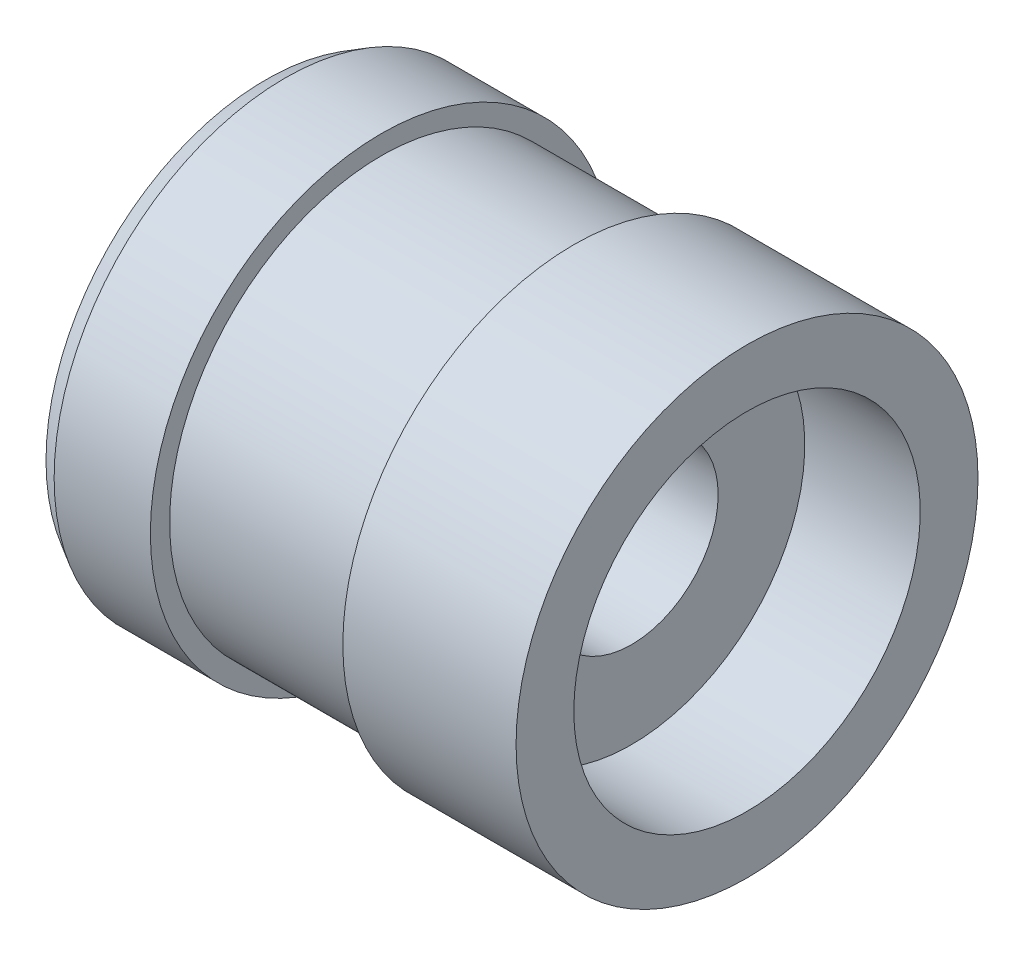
ISO-10303-21;
HEADER;
FILE_DESCRIPTION(('STEP AP214'),'2;1');
FILE_NAME('part.step','',(''),(''),'','','');
FILE_SCHEMA(('AUTOMOTIVE_DESIGN { 1 0 10303 214 1 1 1 1 }'));
ENDSEC;
DATA;
#1=APPLICATION_CONTEXT('core data for automotive mechanical design processes');
#2=APPLICATION_PROTOCOL_DEFINITION('international standard','automotive_design',2000,#1);
#3=PRODUCT_CONTEXT('',#1,'mechanical');
#4=PRODUCT('Part','Part','',(#3));
#5=PRODUCT_RELATED_PRODUCT_CATEGORY('part','',(#4));
#6=PRODUCT_DEFINITION_FORMATION('','',#4);
#7=PRODUCT_DEFINITION_CONTEXT('part definition',#1,'design');
#8=PRODUCT_DEFINITION('design','',#6,#7);
#9=PRODUCT_DEFINITION_SHAPE('','',#8);
#10=(LENGTH_UNIT() NAMED_UNIT(*) SI_UNIT(.MILLI.,.METRE.));
#11=(NAMED_UNIT(*) PLANE_ANGLE_UNIT() SI_UNIT($,.RADIAN.));
#12=(NAMED_UNIT(*) SI_UNIT($,.STERADIAN.) SOLID_ANGLE_UNIT());
#13=UNCERTAINTY_MEASURE_WITH_UNIT(LENGTH_MEASURE(1.E-05),#10,'distance_accuracy_value','');
#14=(GEOMETRIC_REPRESENTATION_CONTEXT(3) GLOBAL_UNCERTAINTY_ASSIGNED_CONTEXT((#13)) GLOBAL_UNIT_ASSIGNED_CONTEXT((#10,
#11,#12)) REPRESENTATION_CONTEXT('',''));
#15=CARTESIAN_POINT('',(0.,0.,0.));
#16=DIRECTION('',(0.,0.,1.));
#17=DIRECTION('',(1.,0.,0.));
#18=AXIS2_PLACEMENT_3D('',#15,#16,#17);
#19=CARTESIAN_POINT('',(0.,0.,0.));
#20=DIRECTION('',(1.,0.,0.));
#21=DIRECTION('',(0.,0.,-1.));
#22=AXIS2_PLACEMENT_3D('',#19,#20,#21);
#23=CYLINDRICAL_SURFACE('',#22,6.);
#24=CARTESIAN_POINT('',(0.5,0.,0.));
#25=DIRECTION('',(-1.,0.,0.));
#26=DIRECTION('',(0.,0.,1.));
#27=AXIS2_PLACEMENT_3D('',#24,#25,#26);
#28=CIRCLE('',#27,6.);
#29=CARTESIAN_POINT('',(0.5,0.,6.));
#30=VERTEX_POINT('',#29);
#31=EDGE_CURVE('E42',#30,#30,#28,.F.);
#32=ORIENTED_EDGE('',*,*,#31,.T.);
#33=EDGE_LOOP('',(#32));
#34=FACE_BOUND('',#33,.T.);
#35=CARTESIAN_POINT('',(3.,0.,0.));
#36=DIRECTION('',(1.,0.,0.));
#37=DIRECTION('',(0.,0.,-1.));
#38=AXIS2_PLACEMENT_3D('',#35,#36,#37);
#39=CIRCLE('',#38,6.);
#40=CARTESIAN_POINT('',(3.,0.,-6.00000000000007));
#41=VERTEX_POINT('',#40);
#42=EDGE_CURVE('E61',#41,#41,#39,.T.);
#43=ORIENTED_EDGE('',*,*,#42,.F.);
#44=EDGE_LOOP('',(#43));
#45=FACE_BOUND('',#44,.T.);
#46=ADVANCED_FACE('F35',(#34,#45),#23,.T.);
#47=CARTESIAN_POINT('',(0.,6.,0.));
#48=DIRECTION('',(-1.,0.,0.));
#49=DIRECTION('',(0.,0.,1.));
#50=AXIS2_PLACEMENT_3D('',#47,#48,#49);
#51=PLANE('',#50);
#52=CARTESIAN_POINT('',(0.,0.,0.));
#53=DIRECTION('',(-1.,0.,0.));
#54=DIRECTION('',(0.,0.,1.));
#55=AXIS2_PLACEMENT_3D('',#52,#53,#54);
#56=CIRCLE('',#55,5.71132486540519);
#57=CARTESIAN_POINT('',(0.,0.,5.71132486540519));
#58=VERTEX_POINT('',#57);
#59=EDGE_CURVE('E10',#58,#58,#56,.T.);
#60=ORIENTED_EDGE('',*,*,#59,.T.);
#61=EDGE_LOOP('',(#60));
#62=FACE_BOUND('',#61,.T.);
#63=CARTESIAN_POINT('',(0.,0.,0.));
#64=DIRECTION('',(-1.,0.,0.));
#65=DIRECTION('',(0.,0.,1.));
#66=AXIS2_PLACEMENT_3D('',#63,#64,#65);
#67=CIRCLE('',#66,0.75);
#68=CARTESIAN_POINT('',(0.,0.,0.75));
#69=VERTEX_POINT('',#68);
#70=EDGE_CURVE('E67',#69,#69,#67,.T.);
#71=ORIENTED_EDGE('',*,*,#70,.F.);
#72=EDGE_LOOP('',(#71));
#73=FACE_BOUND('',#72,.T.);
#74=ADVANCED_FACE('F127',(#62,#73),#51,.T.);
#75=CARTESIAN_POINT('',(12.5,0.,0.));
#76=DIRECTION('',(1.,0.,0.));
#77=DIRECTION('',(0.,0.,-1.));
#78=AXIS2_PLACEMENT_3D('',#75,#76,#77);
#79=PLANE('',#78);
#80=CARTESIAN_POINT('',(12.5,0.,0.));
#81=DIRECTION('',(-1.,0.,0.));
#82=DIRECTION('',(0.,0.,1.));
#83=AXIS2_PLACEMENT_3D('',#80,#81,#82);
#84=CIRCLE('',#83,4.5);
#85=CARTESIAN_POINT('',(12.5,0.,4.5));
#86=VERTEX_POINT('',#85);
#87=EDGE_CURVE('E64',#86,#86,#84,.T.);
#88=ORIENTED_EDGE('',*,*,#87,.T.);
#89=EDGE_LOOP('',(#88));
#90=FACE_BOUND('',#89,.T.);
#91=CARTESIAN_POINT('',(12.5,0.,0.));
#92=DIRECTION('',(1.,0.,0.));
#93=DIRECTION('',(0.,0.,-1.));
#94=AXIS2_PLACEMENT_3D('',#91,#92,#93);
#95=CIRCLE('',#94,6.);
#96=CARTESIAN_POINT('',(12.5,0.,-6.));
#97=VERTEX_POINT('',#96);
#98=EDGE_CURVE('E46',#97,#97,#95,.T.);
#99=ORIENTED_EDGE('',*,*,#98,.T.);
#100=EDGE_LOOP('',(#99));
#101=FACE_BOUND('',#100,.T.);
#102=ADVANCED_FACE('F129',(#90,#101),#79,.T.);
#103=CARTESIAN_POINT('',(0.,0.,0.));
#104=DIRECTION('',(1.,0.,0.));
#105=DIRECTION('',(0.,0.,-1.));
#106=AXIS2_PLACEMENT_3D('',#103,#104,#105);
#107=CYLINDRICAL_SURFACE('',#106,6.);
#108=CARTESIAN_POINT('',(8.,0.,0.));
#109=DIRECTION('',(1.,0.,0.));
#110=DIRECTION('',(0.,0.,-1.));
#111=AXIS2_PLACEMENT_3D('',#108,#109,#110);
#112=CIRCLE('',#111,6.);
#113=CARTESIAN_POINT('',(8.,0.,-6.));
#114=VERTEX_POINT('',#113);
#115=EDGE_CURVE('E50',#114,#114,#112,.T.);
#116=ORIENTED_EDGE('',*,*,#115,.T.);
#117=EDGE_LOOP('',(#116));
#118=FACE_BOUND('',#117,.T.);
#119=ORIENTED_EDGE('',*,*,#98,.F.);
#120=EDGE_LOOP('',(#119));
#121=FACE_BOUND('',#120,.T.);
#122=ADVANCED_FACE('F135',(#118,#121),#107,.T.);
#123=CARTESIAN_POINT('',(8.,6.00000000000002,0.));
#124=DIRECTION('',(-1.,0.,0.));
#125=DIRECTION('',(0.,0.,1.));
#126=AXIS2_PLACEMENT_3D('',#123,#124,#125);
#127=PLANE('',#126);
#128=CARTESIAN_POINT('',(8.,0.,0.));
#129=DIRECTION('',(1.,0.,0.));
#130=DIRECTION('',(0.,0.,-1.));
#131=AXIS2_PLACEMENT_3D('',#128,#129,#130);
#132=CIRCLE('',#131,5.5);
#133=CARTESIAN_POINT('',(8.,0.,-5.5));
#134=VERTEX_POINT('',#133);
#135=EDGE_CURVE('E55',#134,#134,#132,.T.);
#136=ORIENTED_EDGE('',*,*,#135,.T.);
#137=EDGE_LOOP('',(#136));
#138=FACE_BOUND('',#137,.T.);
#139=ORIENTED_EDGE('',*,*,#115,.F.);
#140=EDGE_LOOP('',(#139));
#141=FACE_BOUND('',#140,.T.);
#142=ADVANCED_FACE('F141',(#138,#141),#127,.T.);
#143=CARTESIAN_POINT('',(0.,0.,0.));
#144=DIRECTION('',(1.,0.,0.));
#145=DIRECTION('',(0.,0.,-1.));
#146=AXIS2_PLACEMENT_3D('',#143,#144,#145);
#147=CYLINDRICAL_SURFACE('',#146,5.5);
#148=CARTESIAN_POINT('',(3.,0.,0.));
#149=DIRECTION('',(1.,0.,0.));
#150=DIRECTION('',(0.,0.,-1.));
#151=AXIS2_PLACEMENT_3D('',#148,#149,#150);
#152=CIRCLE('',#151,5.5);
#153=CARTESIAN_POINT('',(3.,0.,-5.50000000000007));
#154=VERTEX_POINT('',#153);
#155=EDGE_CURVE('E58',#154,#154,#152,.T.);
#156=ORIENTED_EDGE('',*,*,#155,.T.);
#157=EDGE_LOOP('',(#156));
#158=FACE_BOUND('',#157,.T.);
#159=ORIENTED_EDGE('',*,*,#135,.F.);
#160=EDGE_LOOP('',(#159));
#161=FACE_BOUND('',#160,.T.);
#162=ADVANCED_FACE('F145',(#158,#161),#147,.T.);
#163=CARTESIAN_POINT('',(3.,5.5,0.));
#164=DIRECTION('',(1.,0.,0.));
#165=DIRECTION('',(0.,0.,-1.));
#166=AXIS2_PLACEMENT_3D('',#163,#164,#165);
#167=PLANE('',#166);
#168=ORIENTED_EDGE('',*,*,#42,.T.);
#169=EDGE_LOOP('',(#168));
#170=FACE_BOUND('',#169,.T.);
#171=ORIENTED_EDGE('',*,*,#155,.F.);
#172=EDGE_LOOP('',(#171));
#173=FACE_BOUND('',#172,.T.);
#174=ADVANCED_FACE('F149',(#170,#173),#167,.T.);
#175=CARTESIAN_POINT('',(12.5,0.,0.));
#176=DIRECTION('',(-1.,0.,0.));
#177=DIRECTION('',(0.,0.,1.));
#178=AXIS2_PLACEMENT_3D('',#175,#176,#177);
#179=CYLINDRICAL_SURFACE('',#178,4.5);
#180=ORIENTED_EDGE('',*,*,#87,.F.);
#181=EDGE_LOOP('',(#180));
#182=FACE_BOUND('',#181,.T.);
#183=CARTESIAN_POINT('',(9.5,0.,0.));
#184=DIRECTION('',(-1.,0.,0.));
#185=DIRECTION('',(0.,0.,1.));
#186=AXIS2_PLACEMENT_3D('',#183,#184,#185);
#187=CIRCLE('',#186,4.5);
#188=CARTESIAN_POINT('',(9.5,0.,4.5));
#189=VERTEX_POINT('',#188);
#190=EDGE_CURVE('E85',#189,#189,#187,.T.);
#191=ORIENTED_EDGE('',*,*,#190,.T.);
#192=EDGE_LOOP('',(#191));
#193=FACE_BOUND('',#192,.T.);
#194=ADVANCED_FACE('F89',(#182,#193),#179,.F.);
#195=CARTESIAN_POINT('',(12.5,0.,0.));
#196=DIRECTION('',(-1.,0.,0.));
#197=DIRECTION('',(0.,0.,1.));
#198=AXIS2_PLACEMENT_3D('',#195,#196,#197);
#199=CYLINDRICAL_SURFACE('',#198,0.75);
#200=CARTESIAN_POINT('',(1.5,0.,0.));
#201=DIRECTION('',(-1.,0.,0.));
#202=DIRECTION('',(0.,0.,1.));
#203=AXIS2_PLACEMENT_3D('',#200,#201,#202);
#204=CIRCLE('',#203,0.75);
#205=CARTESIAN_POINT('',(1.5,0.,0.75));
#206=VERTEX_POINT('',#205);
#207=EDGE_CURVE('E70',#206,#206,#204,.T.);
#208=ORIENTED_EDGE('',*,*,#207,.F.);
#209=EDGE_LOOP('',(#208));
#210=FACE_BOUND('',#209,.T.);
#211=ORIENTED_EDGE('',*,*,#70,.T.);
#212=EDGE_LOOP('',(#211));
#213=FACE_BOUND('',#212,.T.);
#214=ADVANCED_FACE('F118',(#210,#213),#199,.F.);
#215=CARTESIAN_POINT('',(1.5,0.749999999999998,0.));
#216=DIRECTION('',(-1.,0.,0.));
#217=DIRECTION('',(0.,0.,1.));
#218=AXIS2_PLACEMENT_3D('',#215,#216,#217);
#219=PLANE('',#218);
#220=CARTESIAN_POINT('',(1.5,0.,0.));
#221=DIRECTION('',(-1.,0.,0.));
#222=DIRECTION('',(0.,0.,1.));
#223=AXIS2_PLACEMENT_3D('',#220,#221,#222);
#224=CIRCLE('',#223,2.);
#225=CARTESIAN_POINT('',(1.5,0.,2.));
#226=VERTEX_POINT('',#225);
#227=EDGE_CURVE('E73',#226,#226,#224,.T.);
#228=ORIENTED_EDGE('',*,*,#227,.F.);
#229=EDGE_LOOP('',(#228));
#230=FACE_BOUND('',#229,.T.);
#231=ORIENTED_EDGE('',*,*,#207,.T.);
#232=EDGE_LOOP('',(#231));
#233=FACE_BOUND('',#232,.T.);
#234=ADVANCED_FACE('F112',(#230,#233),#219,.F.);
#235=CARTESIAN_POINT('',(12.5,0.,0.));
#236=DIRECTION('',(-1.,0.,0.));
#237=DIRECTION('',(0.,0.,1.));
#238=AXIS2_PLACEMENT_3D('',#235,#236,#237);
#239=CYLINDRICAL_SURFACE('',#238,2.);
#240=CARTESIAN_POINT('',(6.5,0.,0.));
#241=DIRECTION('',(-1.,0.,0.));
#242=DIRECTION('',(0.,0.,1.));
#243=AXIS2_PLACEMENT_3D('',#240,#241,#242);
#244=CIRCLE('',#243,2.);
#245=CARTESIAN_POINT('',(6.5,0.,1.99999999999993));
#246=VERTEX_POINT('',#245);
#247=EDGE_CURVE('E76',#246,#246,#244,.T.);
#248=ORIENTED_EDGE('',*,*,#247,.F.);
#249=EDGE_LOOP('',(#248));
#250=FACE_BOUND('',#249,.T.);
#251=ORIENTED_EDGE('',*,*,#227,.T.);
#252=EDGE_LOOP('',(#251));
#253=FACE_BOUND('',#252,.T.);
#254=ADVANCED_FACE('F106',(#250,#253),#239,.F.);
#255=CARTESIAN_POINT('',(6.5,2.,0.));
#256=DIRECTION('',(-1.,0.,0.));
#257=DIRECTION('',(0.,0.,1.));
#258=AXIS2_PLACEMENT_3D('',#255,#256,#257);
#259=PLANE('',#258);
#260=CARTESIAN_POINT('',(6.5,0.,0.));
#261=DIRECTION('',(-1.,0.,0.));
#262=DIRECTION('',(0.,0.,1.));
#263=AXIS2_PLACEMENT_3D('',#260,#261,#262);
#264=CIRCLE('',#263,2.25);
#265=CARTESIAN_POINT('',(6.5,0.,2.24999999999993));
#266=VERTEX_POINT('',#265);
#267=EDGE_CURVE('E79',#266,#266,#264,.T.);
#268=ORIENTED_EDGE('',*,*,#267,.F.);
#269=EDGE_LOOP('',(#268));
#270=FACE_BOUND('',#269,.T.);
#271=ORIENTED_EDGE('',*,*,#247,.T.);
#272=EDGE_LOOP('',(#271));
#273=FACE_BOUND('',#272,.T.);
#274=ADVANCED_FACE('F100',(#270,#273),#259,.F.);
#275=CARTESIAN_POINT('',(12.5,0.,0.));
#276=DIRECTION('',(-1.,0.,0.));
#277=DIRECTION('',(0.,0.,1.));
#278=AXIS2_PLACEMENT_3D('',#275,#276,#277);
#279=CYLINDRICAL_SURFACE('',#278,2.25);
#280=CARTESIAN_POINT('',(9.5,0.,0.));
#281=DIRECTION('',(-1.,0.,0.));
#282=DIRECTION('',(0.,0.,1.));
#283=AXIS2_PLACEMENT_3D('',#280,#281,#282);
#284=CIRCLE('',#283,2.25);
#285=CARTESIAN_POINT('',(9.5,0.,2.25));
#286=VERTEX_POINT('',#285);
#287=EDGE_CURVE('E82',#286,#286,#284,.T.);
#288=ORIENTED_EDGE('',*,*,#287,.F.);
#289=EDGE_LOOP('',(#288));
#290=FACE_BOUND('',#289,.T.);
#291=ORIENTED_EDGE('',*,*,#267,.T.);
#292=EDGE_LOOP('',(#291));
#293=FACE_BOUND('',#292,.T.);
#294=ADVANCED_FACE('F94',(#290,#293),#279,.F.);
#295=CARTESIAN_POINT('',(9.5,2.25,0.));
#296=DIRECTION('',(-1.,0.,0.));
#297=DIRECTION('',(0.,0.,1.));
#298=AXIS2_PLACEMENT_3D('',#295,#296,#297);
#299=PLANE('',#298);
#300=ORIENTED_EDGE('',*,*,#190,.F.);
#301=EDGE_LOOP('',(#300));
#302=FACE_BOUND('',#301,.T.);
#303=ORIENTED_EDGE('',*,*,#287,.T.);
#304=EDGE_LOOP('',(#303));
#305=FACE_BOUND('',#304,.T.);
#306=ADVANCED_FACE('F91',(#302,#305),#299,.F.);
#307=CARTESIAN_POINT('',(0.5,0.,0.));
#308=DIRECTION('',(1.,0.,0.));
#309=DIRECTION('',(0.,0.,-1.));
#310=AXIS2_PLACEMENT_3D('',#307,#308,#309);
#311=CONICAL_SURFACE('',#310,6.,0.523598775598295);
#312=ORIENTED_EDGE('',*,*,#59,.F.);
#313=EDGE_LOOP('',(#312));
#314=FACE_BOUND('',#313,.T.);
#315=ORIENTED_EDGE('',*,*,#31,.F.);
#316=EDGE_LOOP('',(#315));
#317=FACE_BOUND('',#316,.T.);
#318=ADVANCED_FACE('F37',(#314,#317),#311,.T.);
#319=CLOSED_SHELL('',(#46,#74,#102,#122,#142,#162,#174,#194,#214,#234,#254,#274,#294,#306,#318));
#320=MANIFOLD_SOLID_BREP('B2',#319);
#321=ADVANCED_BREP_SHAPE_REPRESENTATION('',(#18,#320),#14);
#322=SHAPE_DEFINITION_REPRESENTATION(#9,#321);
ENDSEC;
END-ISO-10303-21;
